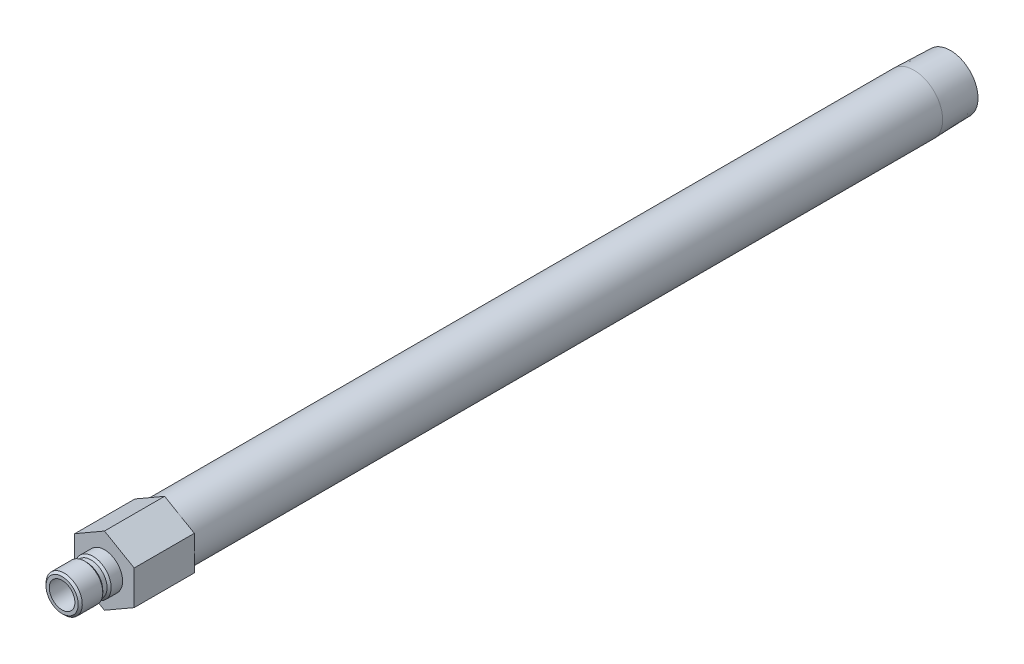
from build123d import *

# Parameters (mm, degrees)
SKETCH2_R           = 4.7625
BOSS_EXTRUDE1_DEPTH = 22.352


with BuildPart() as part:
    # Sketch1 → Revolve1 (revolve)
    with BuildSketch(Plane(origin=(0, 0, 0), x_dir=(0, 0, -1), z_dir=(1, 0, 0))):
        Polygon((-15.748, 4.7625), (-15.748, 5.9817), (-14.986, 6.7437), (-7.366, 6.7437), (-6.604, 5.9817), (-5.0165, 5.9817), (-4.2545, 6.7437), (0, 6.7437), (0, 10.668), (300.8884, 10.668), (314.452, 10.244140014), (314.452, 7.8994), (22.352, 7.8994), (22.352, 4.7625), align=None)
    revolve(axis=Axis((0, 0, 0), (0, 0, 1)))

    # Sketch2 → Boss-Extrude1 (add)
    with BuildSketch(Plane.XY):
        Polygon((-11.049, 6.379143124), (-11.049, -6.379143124), (0, -12.758286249), (11.049, -6.379143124), (11.049, 6.379143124), (0, 12.758286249), align=None)
        with Locations(Location((0, 0, 0), (0, 0, 90))):
            Circle(SKETCH2_R, mode=Mode.SUBTRACT)
    extrude(amount=-BOSS_EXTRUDE1_DEPTH)


solid = part.part
